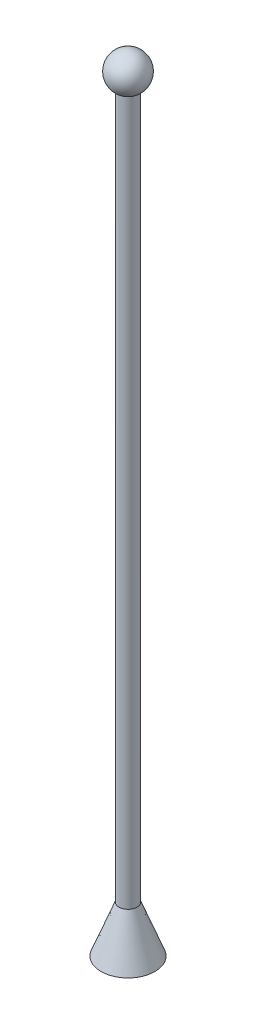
ISO-10303-21;
HEADER;
FILE_DESCRIPTION(('STEP AP214'),'2;1');
FILE_NAME('part.step','',(''),(''),'','','');
FILE_SCHEMA(('AUTOMOTIVE_DESIGN { 1 0 10303 214 1 1 1 1 }'));
ENDSEC;
DATA;
#1=APPLICATION_CONTEXT('core data for automotive mechanical design processes');
#2=APPLICATION_PROTOCOL_DEFINITION('international standard','automotive_design',2000,#1);
#3=PRODUCT_CONTEXT('',#1,'mechanical');
#4=PRODUCT('Part','Part','',(#3));
#5=PRODUCT_RELATED_PRODUCT_CATEGORY('part','',(#4));
#6=PRODUCT_DEFINITION_FORMATION('','',#4);
#7=PRODUCT_DEFINITION_CONTEXT('part definition',#1,'design');
#8=PRODUCT_DEFINITION('design','',#6,#7);
#9=PRODUCT_DEFINITION_SHAPE('','',#8);
#10=(LENGTH_UNIT() NAMED_UNIT(*) SI_UNIT(.MILLI.,.METRE.));
#11=(NAMED_UNIT(*) PLANE_ANGLE_UNIT() SI_UNIT($,.RADIAN.));
#12=(NAMED_UNIT(*) SI_UNIT($,.STERADIAN.) SOLID_ANGLE_UNIT());
#13=UNCERTAINTY_MEASURE_WITH_UNIT(LENGTH_MEASURE(1.E-05),#10,'distance_accuracy_value','');
#14=(GEOMETRIC_REPRESENTATION_CONTEXT(3) GLOBAL_UNCERTAINTY_ASSIGNED_CONTEXT((#13)) GLOBAL_UNIT_ASSIGNED_CONTEXT((#10,
#11,#12)) REPRESENTATION_CONTEXT('',''));
#15=CARTESIAN_POINT('',(0.,0.,0.));
#16=DIRECTION('',(0.,0.,1.));
#17=DIRECTION('',(1.,0.,0.));
#18=AXIS2_PLACEMENT_3D('',#15,#16,#17);
#19=CARTESIAN_POINT('',(0.,541.02,0.));
#20=DIRECTION('',(0.,-1.,0.));
#21=DIRECTION('',(0.,0.,-1.));
#22=AXIS2_PLACEMENT_3D('',#19,#20,#21);
#23=CYLINDRICAL_SURFACE('',#22,6.35);
#24=CARTESIAN_POINT('',(0.,33.02,0.));
#25=DIRECTION('',(0.,1.,0.));
#26=DIRECTION('',(0.,0.,1.));
#27=AXIS2_PLACEMENT_3D('',#24,#25,#26);
#28=CIRCLE('',#27,6.35);
#29=CARTESIAN_POINT('',(0.,33.02,-6.35));
#30=VERTEX_POINT('',#29);
#31=EDGE_CURVE('E44',#30,#30,#28,.T.);
#32=ORIENTED_EDGE('',*,*,#31,.T.);
#33=EDGE_LOOP('',(#32));
#34=FACE_BOUND('',#33,.T.);
#35=CARTESIAN_POINT('',(0.,530.021477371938,0.));
#36=DIRECTION('',(0.,1.,0.));
#37=DIRECTION('',(0.,0.,1.));
#38=AXIS2_PLACEMENT_3D('',#35,#36,#37);
#39=CIRCLE('',#38,6.35);
#40=CARTESIAN_POINT('',(0.,530.021477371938,6.35));
#41=VERTEX_POINT('',#40);
#42=EDGE_CURVE('E11',#41,#41,#39,.T.);
#43=ORIENTED_EDGE('',*,*,#42,.F.);
#44=EDGE_LOOP('',(#43));
#45=FACE_BOUND('',#44,.T.);
#46=ADVANCED_FACE('F32',(#34,#45),#23,.T.);
#47=CARTESIAN_POINT('',(0.,0.,0.));
#48=DIRECTION('',(0.,1.,0.));
#49=DIRECTION('',(0.,0.,1.));
#50=AXIS2_PLACEMENT_3D('',#47,#48,#49);
#51=PLANE('',#50);
#52=CARTESIAN_POINT('',(0.,0.,0.));
#53=DIRECTION('',(0.,1.,0.));
#54=DIRECTION('',(0.,0.,1.));
#55=AXIS2_PLACEMENT_3D('',#52,#53,#54);
#56=CIRCLE('',#55,19.05);
#57=CARTESIAN_POINT('',(0.,0.,-19.05));
#58=VERTEX_POINT('',#57);
#59=EDGE_CURVE('E40',#58,#58,#56,.T.);
#60=ORIENTED_EDGE('',*,*,#59,.F.);
#61=EDGE_LOOP('',(#60));
#62=FACE_BOUND('',#61,.T.);
#63=ADVANCED_FACE('F71',(#62),#51,.F.);
#64=CARTESIAN_POINT('',(0.,33.02,0.));
#65=DIRECTION('',(0.,-1.,0.));
#66=DIRECTION('',(0.,0.,-1.));
#67=AXIS2_PLACEMENT_3D('',#64,#65,#66);
#68=CONICAL_SURFACE('',#67,6.35,0.367173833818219);
#69=CARTESIAN_POINT('',(0.,0.,-19.05));
#70=CARTESIAN_POINT('',(0.,0.343958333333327,-18.9177083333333));
#71=CARTESIAN_POINT('',(0.,0.687916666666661,-18.7854166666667));
#72=CARTESIAN_POINT('',(0.,1.37583333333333,-18.5208333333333));
#73=CARTESIAN_POINT('',(0.,1.71979166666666,-18.3885416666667));
#74=CARTESIAN_POINT('',(0.,2.40770833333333,-18.1239583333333));
#75=CARTESIAN_POINT('',(0.,2.75166666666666,-17.9916666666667));
#76=CARTESIAN_POINT('',(0.,3.43958333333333,-17.7270833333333));
#77=CARTESIAN_POINT('',(0.,3.78354166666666,-17.5947916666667));
#78=CARTESIAN_POINT('',(0.,4.47145833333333,-17.3302083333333));
#79=CARTESIAN_POINT('',(0.,4.81541666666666,-17.1979166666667));
#80=CARTESIAN_POINT('',(0.,5.50333333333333,-16.9333333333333));
#81=CARTESIAN_POINT('',(0.,5.84729166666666,-16.8010416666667));
#82=CARTESIAN_POINT('',(0.,6.53520833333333,-16.5364583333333));
#83=CARTESIAN_POINT('',(0.,6.87916666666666,-16.4041666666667));
#84=CARTESIAN_POINT('',(0.,7.56708333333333,-16.1395833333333));
#85=CARTESIAN_POINT('',(0.,7.91104166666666,-16.0072916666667));
#86=CARTESIAN_POINT('',(0.,8.59895833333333,-15.7427083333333));
#87=CARTESIAN_POINT('',(0.,8.94291666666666,-15.6104166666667));
#88=CARTESIAN_POINT('',(0.,9.63083333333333,-15.3458333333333));
#89=CARTESIAN_POINT('',(0.,9.97479166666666,-15.2135416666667));
#90=CARTESIAN_POINT('',(0.,10.6627083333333,-14.9489583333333));
#91=CARTESIAN_POINT('',(0.,11.0066666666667,-14.8166666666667));
#92=CARTESIAN_POINT('',(0.,11.6945833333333,-14.5520833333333));
#93=CARTESIAN_POINT('',(0.,12.0385416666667,-14.4197916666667));
#94=CARTESIAN_POINT('',(0.,12.7264583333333,-14.1552083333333));
#95=CARTESIAN_POINT('',(0.,13.0704166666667,-14.0229166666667));
#96=CARTESIAN_POINT('',(0.,13.7583333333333,-13.7583333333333));
#97=CARTESIAN_POINT('',(0.,14.1022916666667,-13.6260416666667));
#98=CARTESIAN_POINT('',(0.,14.7902083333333,-13.3614583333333));
#99=CARTESIAN_POINT('',(0.,15.1341666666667,-13.2291666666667));
#100=CARTESIAN_POINT('',(0.,15.8220833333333,-12.9645833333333));
#101=CARTESIAN_POINT('',(0.,16.1660416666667,-12.8322916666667));
#102=CARTESIAN_POINT('',(0.,16.8539583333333,-12.5677083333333));
#103=CARTESIAN_POINT('',(0.,17.1979166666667,-12.4354166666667));
#104=CARTESIAN_POINT('',(0.,17.8858333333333,-12.1708333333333));
#105=CARTESIAN_POINT('',(0.,18.2297916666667,-12.0385416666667));
#106=CARTESIAN_POINT('',(0.,18.9177083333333,-11.7739583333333));
#107=CARTESIAN_POINT('',(0.,19.2616666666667,-11.6416666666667));
#108=CARTESIAN_POINT('',(0.,19.9495833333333,-11.3770833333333));
#109=CARTESIAN_POINT('',(0.,20.2935416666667,-11.2447916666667));
#110=CARTESIAN_POINT('',(0.,20.9814583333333,-10.9802083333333));
#111=CARTESIAN_POINT('',(0.,21.3254166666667,-10.8479166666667));
#112=CARTESIAN_POINT('',(0.,22.0133333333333,-10.5833333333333));
#113=CARTESIAN_POINT('',(0.,22.3572916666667,-10.4510416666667));
#114=CARTESIAN_POINT('',(0.,23.0452083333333,-10.1864583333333));
#115=CARTESIAN_POINT('',(0.,23.3891666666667,-10.0541666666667));
#116=CARTESIAN_POINT('',(0.,24.0770833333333,-9.78958333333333));
#117=CARTESIAN_POINT('',(0.,24.4210416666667,-9.65729166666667));
#118=CARTESIAN_POINT('',(0.,25.1089583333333,-9.39270833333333));
#119=CARTESIAN_POINT('',(0.,25.4529166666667,-9.26041666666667));
#120=CARTESIAN_POINT('',(0.,26.1408333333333,-8.99583333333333));
#121=CARTESIAN_POINT('',(0.,26.4847916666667,-8.86354166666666));
#122=CARTESIAN_POINT('',(0.,27.1727083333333,-8.59895833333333));
#123=CARTESIAN_POINT('',(0.,27.5166666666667,-8.46666666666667));
#124=CARTESIAN_POINT('',(0.,28.2045833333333,-8.20208333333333));
#125=CARTESIAN_POINT('',(0.,28.5485416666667,-8.06979166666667));
#126=CARTESIAN_POINT('',(0.,29.2364583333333,-7.80520833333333));
#127=CARTESIAN_POINT('',(0.,29.5804166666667,-7.67291666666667));
#128=CARTESIAN_POINT('',(0.,30.2683333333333,-7.40833333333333));
#129=CARTESIAN_POINT('',(0.,30.6122916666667,-7.27604166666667));
#130=CARTESIAN_POINT('',(0.,31.3002083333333,-7.01145833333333));
#131=CARTESIAN_POINT('',(0.,31.6441666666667,-6.87916666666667));
#132=CARTESIAN_POINT('',(0.,32.3320833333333,-6.61458333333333));
#133=CARTESIAN_POINT('',(0.,32.6760416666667,-6.48229166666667));
#134=CARTESIAN_POINT('',(0.,33.02,-6.35));
#135=B_SPLINE_CURVE_WITH_KNOTS('',3,(#69,#70,#71,#72,#73,#74,#75,#76,#77,#78,#79,#80,#81,#82,
#83,#84,#85,#86,#87,#88,#89,#90,#91,#92,#93,#94,#95,#96,#97,#98,#99,#100,#101,#102,#103,#104,
#105,#106,#107,#108,#109,#110,#111,#112,#113,#114,#115,#116,#117,#118,#119,#120,#121,#122,#123,
#124,#125,#126,#127,#128,#129,#130,#131,#132,#133,#134),.UNSPECIFIED.,.F.,.F.,(4,2,2,2,2,2,2,2,
2,2,2,2,2,2,2,2,2,2,2,2,2,2,2,2,2,2,2,2,2,2,2,2,4),(0.,1.10556581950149,2.21113163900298,
3.31669745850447,4.42226327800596,5.52782909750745,6.63339491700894,7.73896073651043,
8.84452655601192,9.9500923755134,11.0556581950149,12.1612240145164,13.2667898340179,
14.3723556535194,15.4779214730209,16.5834872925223,17.6890531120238,18.7946189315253,
19.9001847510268,21.0057505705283,22.1113163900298,23.2168822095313,24.3224480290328,
25.4280138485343,26.5335796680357,27.6391454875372,28.7447113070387,29.8502771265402,
30.9558429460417,32.0614087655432,33.1669745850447,34.2725404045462,35.3781062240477),.UNSPECIFIED.);
#136=EDGE_CURVE('BSEAM34',#58,#30,#135,.T.);
#137=ORIENTED_EDGE('',*,*,#59,.T.);
#138=ORIENTED_EDGE('',*,*,#31,.F.);
#139=ORIENTED_EDGE('',*,*,#136,.T.);
#140=ORIENTED_EDGE('',*,*,#136,.F.);
#141=EDGE_LOOP('',(#137,#139,#138,#140));
#142=FACE_BOUND('',#141,.T.);
#143=ADVANCED_FACE('F34',(#142),#68,.T.);
#144=CARTESIAN_POINT('',(0.,541.02,0.));
#145=DIRECTION('',(0.,1.,0.));
#146=DIRECTION('',(0.,0.,-1.));
#147=AXIS2_PLACEMENT_3D('',#144,#145,#146);
#148=SPHERICAL_SURFACE('',#147,12.7);
#149=ORIENTED_EDGE('',*,*,#42,.T.);
#150=EDGE_LOOP('',(#149));
#151=FACE_BOUND('',#150,.T.);
#152=ADVANCED_FACE('F73',(#151),#148,.T.);
#153=CLOSED_SHELL('',(#46,#63,#143,#152));
#154=MANIFOLD_SOLID_BREP('B2',#153);
#155=ADVANCED_BREP_SHAPE_REPRESENTATION('',(#18,#154),#14);
#156=SHAPE_DEFINITION_REPRESENTATION(#9,#155);
ENDSEC;
END-ISO-10303-21;
